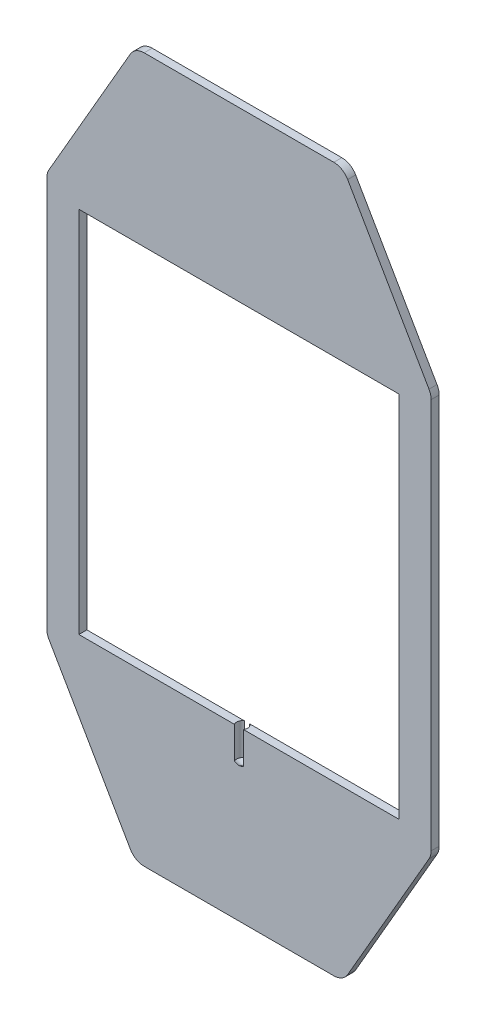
from build123d import *

# Parameters (mm, degrees)
EXTRUDE_1_DEPTH        = 30
EXTRUDE_2_DEPTH        = 40
MIRROR_2_COPY_1_DEPTH  = 40
EXTRUDE_START          = 20
SKETCH_3_W             = 200
SKETCH_3_H             = 230
EXTRUDE_3_DEPTH        = 20
EXTRUDE_START_2        = -10
EXTRUDE_11_DEPTH       = 15
FILLET_3_R             = 5
SKETCH_6_W             = 22
SKETCH_6_H             = 22
EXTRUDE_12_DEPTH       = 225
M8X1_0_1_AT_2_COUNT    = 2
M8X1_0_1_AT_2_PITCH    = 47.5
SKETCH_14_W            = 75
SKETCH_14_H            = 1
CUT_EXTRUDE_1_DEPTH    = 10
EXTRUDE_START_3        = -21
EXTRUDE_13_DEPTH       = 20
CUT_EXTRUDE_3_DEPTH    = 20
FILLET_4_R             = 5
EXTRUDE_14_REACH       = 388.297
EXTRUDE_START_4        = 5
SKETCH_20_W            = 200
SKETCH_20_H            = 230
EXTRUDE_15_DEPTH       = 5
SKETCH_24_W            = 75
SKETCH_24_H            = 85
EXTRUDE_16_DEPTH       = 30
HOLE_WIZARD_M8_1_D     = 6.8
HOLE_WIZARD_M8_1_DEPTH = 20
HOLE_WIZARD_M8_1_TIP   = 2.042926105
EXTRUDE_START_5        = -12
EXTRUDE_17_DEPTH       = 5
PATTERN_LINEAR_2_COUNT = 2
PATTERN_LINEAR_2_PITCH = 26
HOLE_WIZARD_M8_2_D     = 6.8
HOLE_WIZARD_M8_2_DEPTH = 22.5
HOLE_WIZARD_M8_2_TIP   = 2.042926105
SKETCH_32_W            = 15
SKETCH_32_H            = 85
CUT_EXTRUDE_7_DEPTH    = 30
SKETCH_33_W            = 90
SKETCH_33_H            = 85
CUT_EXTRUDE_8_DEPTH    = 12
SKETCH_34_W            = 100
SKETCH_34_H            = 59
CUT_EXTRUDE_9_DEPTH    = 9.25
SKETCH_35_W            = 350.252733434
SKETCH_35_H            = 581.551708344
CUT_EXTRUDE_10_DEPTH   = 21
CUT_EXTRUDE_START      = -5
CUT_EXTRUDE_16_DEPTH   = 252
SKETCH_44_W            = 331.18493543
SKETCH_44_H            = 494.608069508
CUT_EXTRUDE_18_DEPTH   = 542


with BuildPart() as part:
    # Sketch 1 → Extrude 1 (new body)
    with BuildSketch(Plane.XY):
        with BuildLine():
            Line((-118.660254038, 127.025650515), (-67.868239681, 215))
            ThreePointArc((-67.868239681, 215), (-64.207985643, 218.660254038), (-59.207985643, 220))
            Line((-59.207985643, 220), (59.207985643, 220))
            ThreePointArc((59.207985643, 220), (64.207985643, 218.660254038), (67.868239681, 215))
            Line((67.868239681, 215), (118.660254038, 127.025650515))
            ThreePointArc((118.660254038, 127.025650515), (119.659258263, 124.613840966), (120, 122.025650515))
            Line((120, 122.025650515), (120, -122.025650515))
            ThreePointArc((120, -122.025650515), (119.659258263, -124.613840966), (118.660254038, -127.025650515))
            Line((118.660254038, -127.025650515), (67.868239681, -215))
            ThreePointArc((67.868239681, -215), (64.207985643, -218.660254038), (59.207985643, -220))
            Line((59.207985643, -220), (-59.207985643, -220))
            ThreePointArc((-59.207985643, -220), (-64.207985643, -218.660254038), (-67.868239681, -215))
            Line((-67.868239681, -215), (-118.660254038, -127.025650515))
            ThreePointArc((-118.660254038, -127.025650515), (-119.659258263, -124.613840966), (-120, -122.025650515))
            Line((-120, -122.025650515), (-120, 122.025650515))
            ThreePointArc((-120, 122.025650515), (-119.659258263, 124.613840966), (-118.660254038, 127.025650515))
        make_face()
        with BuildLine():
            Line((-98.660254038, 121.666666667), (-56.321234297, 195))
            ThreePointArc((-56.321234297, 195), (-52.660980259, 198.660254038), (-47.660980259, 200))
            Line((-47.660980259, 200), (47.660980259, 200))
            ThreePointArc((47.660980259, 200), (52.660980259, 198.660254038), (56.321234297, 195))
            Line((56.321234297, 195), (98.660254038, 121.666666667))
            ThreePointArc((98.660254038, 121.666666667), (99.659258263, 119.254857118), (100, 116.666666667))
            Line((100, 116.666666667), (100, -116.666666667))
            ThreePointArc((100, -116.666666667), (99.659258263, -119.254857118), (98.660254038, -121.666666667))
            Line((98.660254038, -121.666666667), (56.321234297, -195))
            ThreePointArc((56.321234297, -195), (52.660980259, -198.660254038), (47.660980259, -200))
            Line((47.660980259, -200), (-47.660980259, -200))
            ThreePointArc((-47.660980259, -200), (-52.660980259, -198.660254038), (-56.321234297, -195))
            Line((-56.321234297, -195), (-98.660254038, -121.666666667))
            ThreePointArc((-98.660254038, -121.666666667), (-99.659258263, -119.254857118), (-100, -116.666666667))
            Line((-100, -116.666666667), (-100, 116.666666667))
            ThreePointArc((-100, 116.666666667), (-99.659258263, 119.254857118), (-98.660254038, 121.666666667))
        make_face(mode=Mode.SUBTRACT)
    extrude(amount=EXTRUDE_1_DEPTH)

    # Sketch 2 → Extrude 2 (add)
    with BuildSketch(Plane.XY.offset(30)):
        Polygon((-100, 130), (-70, 130), (-70, 200), (-37.5, 200), (-37.5, 115), (-100, 115), align=None)
    extrude_2 = extrude(amount=-EXTRUDE_2_DEPTH)

    # Mirror 1: Extrude 2 across plane
    add(extrude_2.mirror(Plane.ZX))

    # Mirror 2: Extrude 2 across plane
    add(extrude_2.mirror(Plane(origin=(0, 0, 0), x_dir=(0, 0, 1), z_dir=(1, 0, 0))))

    # Mirror 2 copy 1 sketch → Mirror 2 copy 1 (add)
    with BuildSketch(Plane(origin=(0, 0, 30), x_dir=(-1, 0, 0), z_dir=(0, 0, 1))):
        Polygon((-100, 130), (-70, 130), (-70, 200), (-37.5, 200), (-37.5, 115), (-100, 115), align=None)
    extrude(amount=-MIRROR_2_COPY_1_DEPTH)

    # Sketch 3 → Extrude 3 (add)
    with BuildSketch(Plane(origin=(0, 0, 0), x_dir=(-1, 0, 0), z_dir=(0, 0, -1)).offset(EXTRUDE_START)):
        with BuildLine():
            Line((120, -122.025650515), (120, 122.025650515))
            ThreePointArc((120, 122.025650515), (119.659258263, 124.613840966), (118.660254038, 127.025650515))
            Line((118.660254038, 127.025650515), (67.868239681, 215))
            ThreePointArc((67.868239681, 215), (64.207985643, 218.660254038), (59.207985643, 220))
            Line((59.207985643, 220), (-59.207985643, 220))
            ThreePointArc((-59.207985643, 220), (-64.207985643, 218.660254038), (-67.868239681, 215))
            Line((-67.868239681, 215), (-118.660254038, 127.025650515))
            ThreePointArc((-118.660254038, 127.025650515), (-119.659258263, 124.613840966), (-120, 122.025650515))
            Line((-120, 122.025650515), (-120, -122.025650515))
            ThreePointArc((-120, -122.025650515), (-119.659258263, -124.613840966), (-118.660254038, -127.025650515))
            Line((-118.660254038, -127.025650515), (-67.868239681, -215))
            ThreePointArc((-67.868239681, -215), (-64.207985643, -218.660254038), (-59.207985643, -220))
            Line((-59.207985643, -220), (59.207985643, -220))
            ThreePointArc((59.207985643, -220), (64.207985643, -218.660254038), (67.868239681, -215))
            Line((67.868239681, -215), (118.660254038, -127.025650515))
            ThreePointArc((118.660254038, -127.025650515), (119.659258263, -124.613840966), (120, -122.025650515))
        make_face()
        Rectangle(SKETCH_3_W, SKETCH_3_H, mode=Mode.SUBTRACT)
    extrude(amount=-EXTRUDE_3_DEPTH)

    # Sketch 5 → Extrude 11 (add)
    with BuildSketch(Plane(origin=(0, 0, -20), x_dir=(-1, 0, 0), z_dir=(0, 0, -1)).offset(EXTRUDE_START_2)):
        with BuildLine():
            Line((-67.868239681, 215), (-67.868239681, 310))
            Line((-67.868239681, 310), (67.868239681, 310))
            Line((67.868239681, 310), (67.868239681, 215))
            ThreePointArc((67.868239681, 215), (64.207985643, 218.660254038), (59.207985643, 220))
            Line((59.207985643, 220), (-59.207985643, 220))
            ThreePointArc((-59.207985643, 220), (-64.207985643, 218.660254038), (-67.868239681, 215))
        make_face()
    extrude_11 = extrude(amount=-EXTRUDE_11_DEPTH)

    # Fillet 3
    fillet_3_edges = [part.edges().sort_by_distance(p)[0] for p in [
        (67.868239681, 310, -2.5),
        (-67.868239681, 310, -2.5),
    ]]
    fillet(fillet_3_edges, radius=FILLET_3_R)

    # Sketch 6 → Extrude 12 (add, symmetric)
    with BuildSketch(Plane(origin=(0, 0, 0), x_dir=(0, 0, -1), z_dir=(1, 0, 0))):
        with Locations((6, 210)):
            Rectangle(SKETCH_6_W, SKETCH_6_H)
    extrude_12 = extrude(amount=EXTRUDE_12_DEPTH, both=True)

    # Sketch 11 → M8x1.0 _1 (revolve, cut)
    with BuildSketch(Plane(origin=(-65, 122.5, 30), x_dir=(0, -1, 0), z_dir=(1, 0, 0))):
        Polygon((0, 0), (0, 23.103012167), (3.5, 21), (3.5, 0), align=None)
    m8x1_0_1 = revolve(axis=Axis((-65, 122.5, 36.35), (0, 0, -1)), mode=Mode.SUBTRACT)

    # M8x1.0 _1 at 2: M8x1.0 _1 ×2
    with Locations(*[(0, i * M8X1_0_1_AT_2_PITCH, 0) for i in range(1, M8X1_0_1_AT_2_COUNT)]):
        add(m8x1_0_1, mode=Mode.SUBTRACT)

    # Mirror 7: M8x1.0 _1 across plane
    add(m8x1_0_1.mirror(Plane(origin=(0, 0, 0), x_dir=(0, 0, 1), z_dir=(1, 0, 0))), mode=Mode.SUBTRACT)

    # Mirror 7 copy 1 sketch → Mirror 7 copy 1 (revolve, cut)
    with BuildSketch(Plane(origin=(65, 170, 30), x_dir=(0, -1, 0), z_dir=(-1, 0, 0))):
        Polygon((0, 0), (0, -23.103012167), (3.5, -21), (3.5, 0), align=None)
    revolve(axis=Axis((65, 170, 36.35), (0, 0, 1)), mode=Mode.SUBTRACT)

    # Sketch 14 → Cut-Extrude 1 (cut)
    with BuildSketch(Plane.XY):
        with Locations((0, 199.5)):
            Rectangle(SKETCH_14_W, SKETCH_14_H)
    cut_extrude_1 = extrude(amount=CUT_EXTRUDE_1_DEPTH, mode=Mode.SUBTRACT)

    # Mirror 8: Extrude 11, Extrude 12, Cut-Extrude 1 across plane
    add(extrude_11.mirror(Plane.ZX))
    add(extrude_12.mirror(Plane.ZX))
    add(cut_extrude_1.mirror(Plane.ZX), mode=Mode.SUBTRACT)

    # Sketch 16 → Extrude 13 (add)
    with BuildSketch(Plane.XY.offset(5).offset(EXTRUDE_START_3)):
        with BuildLine():
            Line((135, 199), (135, -199))
            Line((135, -199), (77.105843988, -199))
            Line((77.105843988, -199), (118.660254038, -127.025650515))
            ThreePointArc((118.660254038, -127.025650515), (119.659258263, -124.613840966), (120, -122.025650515))
            Line((120, -122.025650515), (120, 122.025650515))
            ThreePointArc((120, 122.025650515), (119.659258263, 124.613840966), (118.660254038, 127.025650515))
            Line((118.660254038, 127.025650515), (77.105843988, 199))
            Line((77.105843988, 199), (135, 199))
        make_face()
        with BuildLine():
            Line((-135, 199), (-77.105843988, 199))
            Line((-77.105843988, 199), (-118.660254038, 127.025650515))
            ThreePointArc((-118.660254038, 127.025650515), (-119.659258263, 124.613840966), (-120, 122.025650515))
            Line((-120, 122.025650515), (-120, -122.025650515))
            ThreePointArc((-120, -122.025650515), (-119.659258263, -124.613840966), (-118.660254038, -127.025650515))
            Line((-118.660254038, -127.025650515), (-77.105843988, -199))
            Line((-77.105843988, -199), (-135, -199))
            Line((-135, -199), (-135, 199))
        make_face()
    extrude(amount=EXTRUDE_13_DEPTH)

    # Sketch 17 → Cut-Extrude 3 (cut)
    with BuildSketch(Plane.XY.offset(4)):
        Polygon((105.973357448, 199), (135, 148.724380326), (135, 199), align=None)
        Polygon((135, -199), (105.973357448, -199), (135, -148.724380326), align=None)
        Polygon((-105.973357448, -199), (-135, -148.724380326), (-135, -199), align=None)
        Polygon((-135, 199), (-105.973357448, 199), (-135, 148.724380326), align=None)
    extrude(amount=-CUT_EXTRUDE_3_DEPTH, mode=Mode.SUBTRACT)

    # Fillet 4
    fillet_4_edges = [part.edges().sort_by_distance(p)[0] for p in [
        (-135, 148.724380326, -6),
        (-105.973357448, 199, -6),
        (-105.973357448, -199, -6),
        (-135, -148.724380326, -6),
        (135, -148.724380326, -6),
        (105.973357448, -199, -6),
        (105.973357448, 199, -6),
        (135, 148.724380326, -6),
    ]]
    fillet(fillet_4_edges, radius=FILLET_4_R)

    # Sketch 19 → Extrude 14 (add, up to next)
    with BuildSketch(Plane.XY.offset(30), mode=Mode.PRIVATE) as extrude_14_sk1:
        Polygon((-93.849001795, 130), (-70, 130), (-70, 171.307682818), align=None)
    extrude_14_tool1 = extrude(extrude_14_sk1.sketch, amount=-EXTRUDE_14_REACH, mode=Mode.PRIVATE) - part.part
    # Sketch 19 → Extrude 14 (add, up to next)
    with BuildSketch(Plane.XY.offset(30), mode=Mode.PRIVATE) as extrude_14_sk2:
        Polygon((93.849001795, 130), (70, 171.307682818), (70, 130), align=None)
    extrude_14_tool2 = extrude(extrude_14_sk2.sketch, amount=-EXTRUDE_14_REACH, mode=Mode.PRIVATE) - part.part
    # Sketch 19 → Extrude 14 (add, up to next)
    with BuildSketch(Plane.XY.offset(30), mode=Mode.PRIVATE) as extrude_14_sk3:
        Polygon((93.849001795, -130), (70, -130), (70, -171.307682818), align=None)
    extrude_14_tool3 = extrude(extrude_14_sk3.sketch, amount=-EXTRUDE_14_REACH, mode=Mode.PRIVATE) - part.part
    # Sketch 19 → Extrude 14 (add, up to next)
    with BuildSketch(Plane.XY.offset(30), mode=Mode.PRIVATE) as extrude_14_sk4:
        Polygon((-93.849001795, -130), (-70, -171.307682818), (-70, -130), align=None)
    extrude_14_tool4 = extrude(extrude_14_sk4.sketch, amount=-EXTRUDE_14_REACH, mode=Mode.PRIVATE) - part.part
    add(extrude_14_tool1.solids().sort_by_distance((-77.949667, 143.769228, 30))[0])
    add(extrude_14_tool2.solids().sort_by_distance((77.949667, 143.769228, 30))[0])
    add(extrude_14_tool3.solids().sort_by_distance((77.949667, -143.769228, 30))[0])
    add(extrude_14_tool4.solids().sort_by_distance((-77.949667, -143.769228, 30))[0])

    # Sketch 20 → Extrude 15 (add)
    with BuildSketch(Plane(origin=(0, 0, -20), x_dir=(-1, 0, 0), z_dir=(0, 0, -1)).offset(EXTRUDE_START_4)):
        with BuildLine():
            Line((120, -122.025650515), (120, 122.025650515))
            ThreePointArc((120, 122.025650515), (119.659258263, 124.613840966), (118.660254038, 127.025650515))
            Line((118.660254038, 127.025650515), (67.868239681, 215))
            ThreePointArc((67.868239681, 215), (64.207985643, 218.660254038), (59.207985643, 220))
            Line((59.207985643, 220), (-59.207985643, 220))
            ThreePointArc((-59.207985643, 220), (-64.207985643, 218.660254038), (-67.868239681, 215))
            Line((-67.868239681, 215), (-118.660254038, 127.025650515))
            ThreePointArc((-118.660254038, 127.025650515), (-119.659258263, 124.613840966), (-120, 122.025650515))
            Line((-120, 122.025650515), (-120, -122.025650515))
            ThreePointArc((-120, -122.025650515), (-119.659258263, -124.613840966), (-118.660254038, -127.025650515))
            Line((-118.660254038, -127.025650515), (-67.868239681, -215))
            ThreePointArc((-67.868239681, -215), (-64.207985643, -218.660254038), (-59.207985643, -220))
            Line((-59.207985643, -220), (59.207985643, -220))
            ThreePointArc((59.207985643, -220), (64.207985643, -218.660254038), (67.868239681, -215))
            Line((67.868239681, -215), (118.660254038, -127.025650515))
            ThreePointArc((118.660254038, -127.025650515), (119.659258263, -124.613840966), (120, -122.025650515))
        make_face()
        Rectangle(SKETCH_20_W, SKETCH_20_H, mode=Mode.SUBTRACT)
    extrude(amount=-EXTRUDE_15_DEPTH)

    # Sketch 24 → Extrude 16 (add)
    with BuildSketch(Plane.XY):
        with Locations((0, -157.5)):
            Rectangle(SKETCH_24_W, SKETCH_24_H)
    extrude(amount=EXTRUDE_16_DEPTH)

    # Hole Wizard M8 _1
    with Locations(Plane(origin=(0, -115, -22), x_dir=(0, 0, 1), z_dir=(0, 1, 0))):
        with Locations((0, 0)):
            Hole(HOLE_WIZARD_M8_1_D / 2, depth=HOLE_WIZARD_M8_1_DEPTH)
            with Locations((0, 0, -(HOLE_WIZARD_M8_1_DEPTH + HOLE_WIZARD_M8_1_TIP / 2))):  # 118° drill point
                Cone(0, HOLE_WIZARD_M8_1_D / 2, HOLE_WIZARD_M8_1_TIP, mode=Mode.SUBTRACT)

    # Sketch 27 → Extrude 17 (add)
    with BuildSketch(Plane.XY.offset(30).offset(EXTRUDE_START_5)):
        Polygon((-16, -115), (-16, -105), (16, -105), (16, -115), (12, -115), (12, -111), (-12, -111), (-12, -115), align=None)
    extrude_17 = extrude(amount=-EXTRUDE_17_DEPTH)

    # Pattern Linear 2: Extrude 17 ×2
    with Locations(*[(0, 0, -i * PATTERN_LINEAR_2_PITCH) for i in range(1, PATTERN_LINEAR_2_COUNT)]):
        add(extrude_17)

    # Hole Wizard M8 _2
    with Locations(Plane(origin=(-32, -152, 30), x_dir=(1, 0, 0), z_dir=(0, 0, 1))):
        with Locations((0, 0), (64, 0)):
            Hole(HOLE_WIZARD_M8_2_D / 2, depth=HOLE_WIZARD_M8_2_DEPTH)
            with Locations((0, 0, -(HOLE_WIZARD_M8_2_DEPTH + HOLE_WIZARD_M8_2_TIP / 2))):  # 118° drill point
                Cone(0, HOLE_WIZARD_M8_2_D / 2, HOLE_WIZARD_M8_2_TIP, mode=Mode.SUBTRACT)

    # Sketch 32 → Cut-Extrude 7 (cut)
    with BuildSketch(Plane.XY.offset(30)):
        with Locations((-45, 157.5)):
            Rectangle(SKETCH_32_W, SKETCH_32_H)
    extrude(amount=-CUT_EXTRUDE_7_DEPTH, mode=Mode.SUBTRACT)

    # Sketch 33 → Cut-Extrude 8 (cut)
    with BuildSketch(Plane.XY):
        with Locations((-7.5, 157.5)):
            Rectangle(SKETCH_33_W, SKETCH_33_H)
    extrude(amount=-CUT_EXTRUDE_8_DEPTH, mode=Mode.SUBTRACT)

    # Sketch 34 → Cut-Extrude 9 (cut)
    with BuildSketch(Plane.XY.offset(30)):
        with Locations((0, -144.5)):
            Rectangle(SKETCH_34_W, SKETCH_34_H)
    extrude(amount=-CUT_EXTRUDE_9_DEPTH, mode=Mode.SUBTRACT)

    # Sketch 35 → Cut-Extrude 10 (cut)
    with BuildSketch(Plane.XY.offset(30)):
        Rectangle(SKETCH_35_W, SKETCH_35_H)
    extrude(amount=-CUT_EXTRUDE_10_DEPTH, mode=Mode.SUBTRACT)

    # Sketch 43 → Cut-Extrude 16 (cut)
    with BuildSketch(Plane(origin=(0, 0, -25), x_dir=(-1, 0, 0), z_dir=(0, 0, -1)).offset(CUT_EXTRUDE_START)):
        with BuildLine():
            ThreePointArc((118.660254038, -127.025650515), (119.659258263, -124.613840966), (120, -122.025650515))
            Line((120, -122.025650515), (120, 122.025650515))
            ThreePointArc((120, 122.025650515), (119.659258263, 124.613840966), (118.660254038, 127.025650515))
            Line((118.660254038, 127.025650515), (67.868239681, 215))
            ThreePointArc((67.868239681, 215), (64.207985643, 218.660254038), (59.207985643, 220))
            Line((59.207985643, 220), (-59.207985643, 220))
            ThreePointArc((-59.207985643, 220), (-64.207985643, 218.660254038), (-67.868239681, 215))
            Line((-67.868239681, 215), (-118.660254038, 127.025650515))
            ThreePointArc((-118.660254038, 127.025650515), (-119.659258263, 124.613840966), (-120, 122.025650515))
            Line((-120, 122.025650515), (-120, -122.025650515))
            ThreePointArc((-120, -122.025650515), (-119.659258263, -124.613840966), (-118.660254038, -127.025650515))
            Line((-118.660254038, -127.025650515), (-67.868239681, -215))
            ThreePointArc((-67.868239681, -215), (-64.207985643, -218.660254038), (-59.207985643, -220))
            Line((-59.207985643, -220), (59.207985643, -220))
            ThreePointArc((59.207985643, -220), (64.207985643, -218.660254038), (67.868239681, -215))
            Line((67.868239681, -215), (118.660254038, -127.025650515))
        make_face()
        with BuildLine():
            Line((-1.6, -115), (-100, -115))
            Line((-100, -115), (-100, 115))
            Line((-100, 115), (100, 115))
            Line((100, 115), (100, -115))
            Line((100, -115), (1.6, -115))
            Line((1.6, -115), (1.6, -135))
            add(Edge.make_bspline(
                [(1.6, -135), (0, -135.452412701), (-1.6, -135)],
                knots=[-0.510825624, -0.510825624, -0.510825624, 0.510825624, 0.510825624, 0.510825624], degree=2, weights=[1, 1.133333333, 1]))
            Line((-1.6, -135), (-1.6, -115))
        make_face(mode=Mode.SUBTRACT)
    extrude(amount=-CUT_EXTRUDE_16_DEPTH, mode=Mode.SUBTRACT)


with BuildPart() as cut_extrude_16_piece_1:
    # of the separate pieces the step leaves, piece 1, a body of its own (cut_extrude_16_pieces_kept)
    add(part.part.solids().sort_by_distance((-118.660254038, 127.025650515, -20))[0])


with BuildPart() as cut_extrude_16_piece_2:
    # of the separate pieces the step leaves, piece 2, a body of its own (cut_extrude_16_pieces_kept)
    add(part.part.solids().sort_by_distance((-1.6, -115, 9))[0])


with BuildPart() as cut_extrude_16_piece_3:
    # of the separate pieces the step leaves, piece 3, a body of its own (cut_extrude_16_pieces_kept)
    add(part.part.solids().sort_by_distance((16, -105, -8))[0])


with BuildPart() as cut_extrude_18_tool:
    # Sketch 44 → Cut-Extrude 18 (new body)
    with BuildSketch(Plane.XY.offset(-20)):
        Rectangle(SKETCH_44_W, SKETCH_44_H)
    extrude(amount=CUT_EXTRUDE_18_DEPTH)


with BuildPart() as cut_extrude_16_piece_2_1:
    add(cut_extrude_16_piece_2.part)

    # Cut-Extrude 18: cut by cut_extrude_18_tool
    add(cut_extrude_18_tool.part, mode=Mode.SUBTRACT)


with BuildPart() as cut_extrude_16_piece_3_1:
    add(cut_extrude_16_piece_3.part)

    # Cut-Extrude 18: cut by cut_extrude_18_tool
    add(cut_extrude_18_tool.part, mode=Mode.SUBTRACT)


solid = cut_extrude_16_piece_1.part
